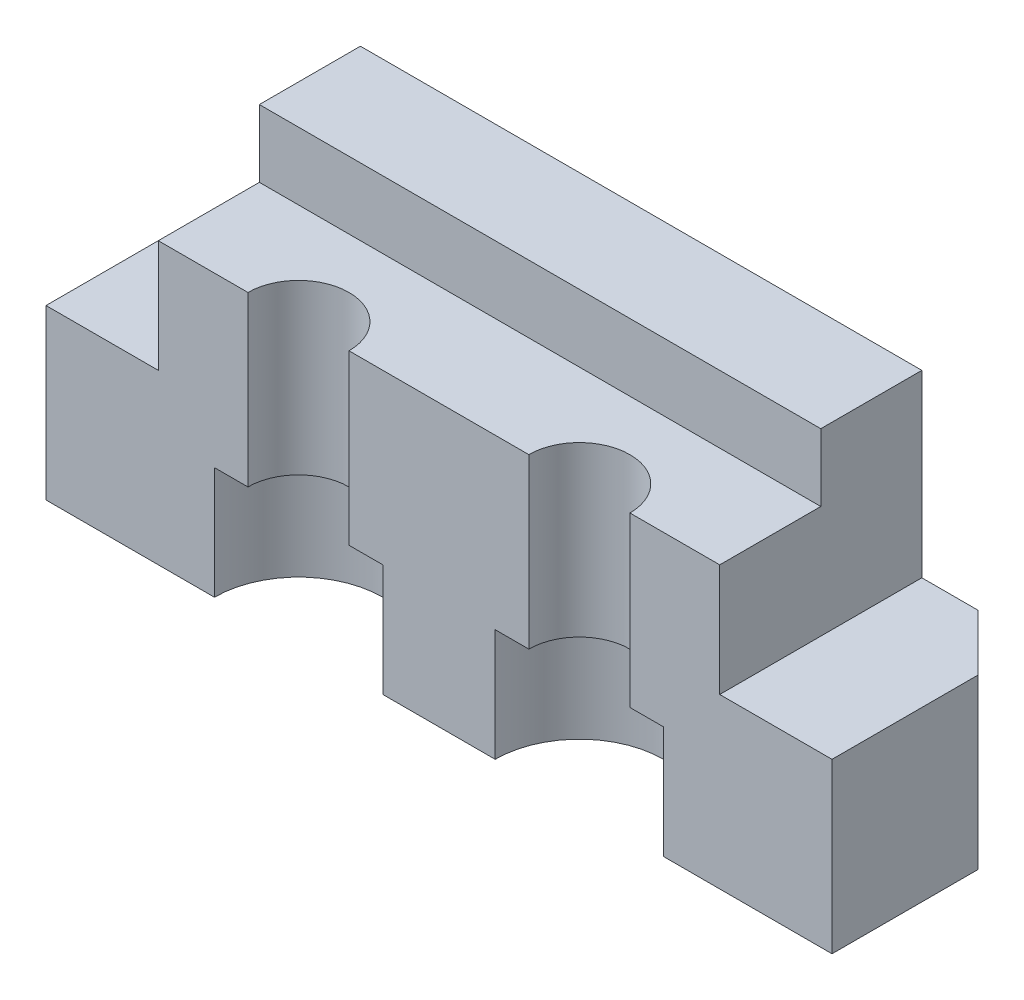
ISO-10303-21;
HEADER;
FILE_DESCRIPTION(('STEP AP214'),'2;1');
FILE_NAME('part.step','',(''),(''),'','','');
FILE_SCHEMA(('AUTOMOTIVE_DESIGN { 1 0 10303 214 1 1 1 1 }'));
ENDSEC;
DATA;
#1=APPLICATION_CONTEXT('core data for automotive mechanical design processes');
#2=APPLICATION_PROTOCOL_DEFINITION('international standard','automotive_design',2000,#1);
#3=PRODUCT_CONTEXT('',#1,'mechanical');
#4=PRODUCT('Part','Part','',(#3));
#5=PRODUCT_RELATED_PRODUCT_CATEGORY('part','',(#4));
#6=PRODUCT_DEFINITION_FORMATION('','',#4);
#7=PRODUCT_DEFINITION_CONTEXT('part definition',#1,'design');
#8=PRODUCT_DEFINITION('design','',#6,#7);
#9=PRODUCT_DEFINITION_SHAPE('','',#8);
#10=(LENGTH_UNIT() NAMED_UNIT(*) SI_UNIT(.MILLI.,.METRE.));
#11=(NAMED_UNIT(*) PLANE_ANGLE_UNIT() SI_UNIT($,.RADIAN.));
#12=(NAMED_UNIT(*) SI_UNIT($,.STERADIAN.) SOLID_ANGLE_UNIT());
#13=UNCERTAINTY_MEASURE_WITH_UNIT(LENGTH_MEASURE(1.E-05),#10,'distance_accuracy_value','');
#14=(GEOMETRIC_REPRESENTATION_CONTEXT(3) GLOBAL_UNCERTAINTY_ASSIGNED_CONTEXT((#13)) GLOBAL_UNIT_ASSIGNED_CONTEXT((#10,
#11,#12)) REPRESENTATION_CONTEXT('',''));
#15=CARTESIAN_POINT('',(0.,0.,0.));
#16=DIRECTION('',(0.,0.,1.));
#17=DIRECTION('',(1.,0.,0.));
#18=AXIS2_PLACEMENT_3D('',#15,#16,#17);
#19=CARTESIAN_POINT('',(70.,0.,-36.));
#20=DIRECTION('',(0.,-1.,0.));
#21=DIRECTION('',(1.,0.,0.));
#22=AXIS2_PLACEMENT_3D('',#19,#20,#21);
#23=PLANE('',#22);
#24=DIRECTION('',(-1.,0.,0.));
#25=VECTOR('',#24,1.);
#26=CARTESIAN_POINT('',(-2.5593542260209,0.,-18.));
#27=LINE('',#26,#25);
#28=CARTESIAN_POINT('',(15.,0.,-18.));
#29=VERTEX_POINT('',#28);
#30=CARTESIAN_POINT('',(0.,0.,-18.));
#31=VERTEX_POINT('',#30);
#32=EDGE_CURVE('E279',#29,#31,#27,.T.);
#33=ORIENTED_EDGE('',*,*,#32,.T.);
#34=DIRECTION('',(0.,0.,1.));
#35=VECTOR('',#34,1.);
#36=CARTESIAN_POINT('',(0.,0.,-36.));
#37=LINE('',#36,#35);
#38=CARTESIAN_POINT('',(0.,0.,-30.9999999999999));
#39=VERTEX_POINT('',#38);
#40=EDGE_CURVE('E203',#39,#31,#37,.T.);
#41=ORIENTED_EDGE('',*,*,#40,.F.);
#42=DIRECTION('',(0.707106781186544,0.,-0.707106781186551));
#43=VECTOR('',#42,1.);
#44=CARTESIAN_POINT('',(37.4999999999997,0.,-68.5));
#45=LINE('',#44,#43);
#46=CARTESIAN_POINT('',(5.00000000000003,0.,-36.));
#47=VERTEX_POINT('',#46);
#48=EDGE_CURVE('E259',#39,#47,#45,.T.);
#49=ORIENTED_EDGE('',*,*,#48,.T.);
#50=DIRECTION('',(1.,0.,0.));
#51=VECTOR('',#50,1.);
#52=CARTESIAN_POINT('',(70.,0.,-36.));
#53=LINE('',#52,#51);
#54=CARTESIAN_POINT('',(65.,0.,-36.));
#55=VERTEX_POINT('',#54);
#56=EDGE_CURVE('E199',#47,#55,#53,.T.);
#57=ORIENTED_EDGE('',*,*,#56,.T.);
#58=DIRECTION('',(0.707106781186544,0.,0.707106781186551));
#59=VECTOR('',#58,1.);
#60=CARTESIAN_POINT('',(67.5,0.,-33.5));
#61=LINE('',#60,#59);
#62=CARTESIAN_POINT('',(70.,0.,-30.9999999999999));
#63=VERTEX_POINT('',#62);
#64=EDGE_CURVE('E261',#55,#63,#61,.T.);
#65=ORIENTED_EDGE('',*,*,#64,.T.);
#66=DIRECTION('',(0.,0.,1.));
#67=VECTOR('',#66,1.);
#68=CARTESIAN_POINT('',(70.,0.,-36.));
#69=LINE('',#68,#67);
#70=CARTESIAN_POINT('',(70.,0.,-18.));
#71=VERTEX_POINT('',#70);
#72=EDGE_CURVE('E200',#63,#71,#69,.T.);
#73=ORIENTED_EDGE('',*,*,#72,.T.);
#74=CARTESIAN_POINT('',(55.,0.,-18.));
#75=VERTEX_POINT('',#74);
#76=EDGE_CURVE('E284',#71,#75,#27,.T.);
#77=ORIENTED_EDGE('',*,*,#76,.T.);
#78=CARTESIAN_POINT('',(47.5,0.,-18.));
#79=DIRECTION('',(0.,-1.,0.));
#80=DIRECTION('',(1.,0.,0.));
#81=AXIS2_PLACEMENT_3D('',#78,#79,#80);
#82=CIRCLE('',#81,7.5);
#83=CARTESIAN_POINT('',(40.,0.,-18.));
#84=VERTEX_POINT('',#83);
#85=EDGE_CURVE('E241',#84,#75,#82,.T.);
#86=ORIENTED_EDGE('',*,*,#85,.F.);
#87=CARTESIAN_POINT('',(30.,0.,-18.));
#88=VERTEX_POINT('',#87);
#89=EDGE_CURVE('E285',#84,#88,#27,.T.);
#90=ORIENTED_EDGE('',*,*,#89,.T.);
#91=CARTESIAN_POINT('',(22.5,0.,-18.));
#92=DIRECTION('',(0.,-1.,0.));
#93=DIRECTION('',(1.,0.,0.));
#94=AXIS2_PLACEMENT_3D('',#91,#92,#93);
#95=CIRCLE('',#94,7.5);
#96=EDGE_CURVE('E207',#29,#88,#95,.T.);
#97=ORIENTED_EDGE('',*,*,#96,.F.);
#98=EDGE_LOOP('',(#33,#41,#49,#57,#65,#73,#77,#86,#90,#97));
#99=FACE_BOUND('',#98,.T.);
#100=ADVANCED_FACE('F26',(#99),#23,.T.);
#101=CARTESIAN_POINT('',(0.,0.,-36.));
#102=DIRECTION('',(-1.,0.,0.));
#103=DIRECTION('',(0.,0.,1.));
#104=AXIS2_PLACEMENT_3D('',#101,#102,#103);
#105=PLANE('',#104);
#106=DIRECTION('',(0.,1.,0.));
#107=VECTOR('',#106,1.);
#108=CARTESIAN_POINT('',(0.,32.9264007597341,-18.));
#109=LINE('',#108,#107);
#110=CARTESIAN_POINT('',(0.,15.,-18.));
#111=VERTEX_POINT('',#110);
#112=EDGE_CURVE('E282',#31,#111,#109,.T.);
#113=ORIENTED_EDGE('',*,*,#112,.T.);
#114=DIRECTION('',(0.,0.,1.));
#115=VECTOR('',#114,1.);
#116=CARTESIAN_POINT('',(0.,15.,-36.));
#117=LINE('',#116,#115);
#118=CARTESIAN_POINT('',(0.,15.,-30.9999999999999));
#119=VERTEX_POINT('',#118);
#120=EDGE_CURVE('E222',#119,#111,#117,.T.);
#121=ORIENTED_EDGE('',*,*,#120,.F.);
#122=DIRECTION('',(0.,-1.,0.));
#123=VECTOR('',#122,1.);
#124=CARTESIAN_POINT('',(0.,0.,-30.9999999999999));
#125=LINE('',#124,#123);
#126=EDGE_CURVE('E34',#119,#39,#125,.T.);
#127=ORIENTED_EDGE('',*,*,#126,.T.);
#128=ORIENTED_EDGE('',*,*,#40,.T.);
#129=EDGE_LOOP('',(#113,#121,#127,#128));
#130=FACE_BOUND('',#129,.T.);
#131=ADVANCED_FACE('F272',(#130),#105,.T.);
#132=CARTESIAN_POINT('',(0.,15.,-36.));
#133=DIRECTION('',(0.,1.,0.));
#134=DIRECTION('',(0.,0.,1.));
#135=AXIS2_PLACEMENT_3D('',#132,#133,#134);
#136=PLANE('',#135);
#137=DIRECTION('',(1.,0.,0.));
#138=VECTOR('',#137,1.);
#139=CARTESIAN_POINT('',(-2.5593542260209,15.,-18.));
#140=LINE('',#139,#138);
#141=CARTESIAN_POINT('',(10.,15.,-18.));
#142=VERTEX_POINT('',#141);
#143=EDGE_CURVE('E179',#111,#142,#140,.T.);
#144=ORIENTED_EDGE('',*,*,#143,.T.);
#145=DIRECTION('',(0.,0.,1.));
#146=VECTOR('',#145,1.);
#147=CARTESIAN_POINT('',(10.,15.,-36.));
#148=LINE('',#147,#146);
#149=CARTESIAN_POINT('',(10.,15.,-36.));
#150=VERTEX_POINT('',#149);
#151=EDGE_CURVE('E178',#150,#142,#148,.T.);
#152=ORIENTED_EDGE('',*,*,#151,.F.);
#153=DIRECTION('',(-1.,0.,0.));
#154=VECTOR('',#153,1.);
#155=CARTESIAN_POINT('',(0.,15.,-36.));
#156=LINE('',#155,#154);
#157=CARTESIAN_POINT('',(5.00000000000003,15.,-36.));
#158=VERTEX_POINT('',#157);
#159=EDGE_CURVE('E225',#150,#158,#156,.T.);
#160=ORIENTED_EDGE('',*,*,#159,.T.);
#161=DIRECTION('',(-0.707106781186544,0.,0.707106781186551));
#162=VECTOR('',#161,1.);
#163=CARTESIAN_POINT('',(2.50000000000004,15.,-33.5));
#164=LINE('',#163,#162);
#165=EDGE_CURVE('E11',#158,#119,#164,.T.);
#166=ORIENTED_EDGE('',*,*,#165,.T.);
#167=ORIENTED_EDGE('',*,*,#120,.T.);
#168=EDGE_LOOP('',(#144,#152,#160,#166,#167));
#169=FACE_BOUND('',#168,.T.);
#170=ADVANCED_FACE('F336',(#169),#136,.T.);
#171=CARTESIAN_POINT('',(10.,15.,-36.));
#172=DIRECTION('',(-1.,0.,0.));
#173=DIRECTION('',(0.,0.,1.));
#174=AXIS2_PLACEMENT_3D('',#171,#172,#173);
#175=PLANE('',#174);
#176=DIRECTION('',(0.,1.,0.));
#177=VECTOR('',#176,1.);
#178=CARTESIAN_POINT('',(10.,32.9264007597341,-18.));
#179=LINE('',#178,#177);
#180=CARTESIAN_POINT('',(10.,25.,-18.));
#181=VERTEX_POINT('',#180);
#182=EDGE_CURVE('E162',#142,#181,#179,.T.);
#183=ORIENTED_EDGE('',*,*,#182,.T.);
#184=DIRECTION('',(0.,0.,1.));
#185=VECTOR('',#184,1.);
#186=CARTESIAN_POINT('',(10.,25.,-36.));
#187=LINE('',#186,#185);
#188=CARTESIAN_POINT('',(10.,25.,-27.));
#189=VERTEX_POINT('',#188);
#190=EDGE_CURVE('E176',#189,#181,#187,.T.);
#191=ORIENTED_EDGE('',*,*,#190,.F.);
#192=DIRECTION('',(0.,-1.,0.));
#193=VECTOR('',#192,1.);
#194=CARTESIAN_POINT('',(10.,15.,-27.));
#195=LINE('',#194,#193);
#196=CARTESIAN_POINT('',(10.,31.,-27.));
#197=VERTEX_POINT('',#196);
#198=EDGE_CURVE('E189',#197,#189,#195,.T.);
#199=ORIENTED_EDGE('',*,*,#198,.F.);
#200=DIRECTION('',(0.,0.,1.));
#201=VECTOR('',#200,1.);
#202=CARTESIAN_POINT('',(10.,31.,-36.));
#203=LINE('',#202,#201);
#204=CARTESIAN_POINT('',(10.,31.,-36.));
#205=VERTEX_POINT('',#204);
#206=EDGE_CURVE('E216',#205,#197,#203,.T.);
#207=ORIENTED_EDGE('',*,*,#206,.F.);
#208=DIRECTION('',(0.,-1.,0.));
#209=VECTOR('',#208,1.);
#210=CARTESIAN_POINT('',(10.,15.,-36.));
#211=LINE('',#210,#209);
#212=EDGE_CURVE('E221',#205,#150,#211,.T.);
#213=ORIENTED_EDGE('',*,*,#212,.T.);
#214=ORIENTED_EDGE('',*,*,#151,.T.);
#215=EDGE_LOOP('',(#183,#191,#199,#207,#213,#214));
#216=FACE_BOUND('',#215,.T.);
#217=ADVANCED_FACE('F174',(#216),#175,.T.);
#218=CARTESIAN_POINT('',(10.,31.,-36.));
#219=DIRECTION('',(0.,1.,0.));
#220=DIRECTION('',(0.,0.,1.));
#221=AXIS2_PLACEMENT_3D('',#218,#219,#220);
#222=PLANE('',#221);
#223=DIRECTION('',(-1.,0.,0.));
#224=VECTOR('',#223,1.);
#225=CARTESIAN_POINT('',(10.,31.,-27.));
#226=LINE('',#225,#224);
#227=CARTESIAN_POINT('',(60.,31.,-27.));
#228=VERTEX_POINT('',#227);
#229=EDGE_CURVE('E186',#228,#197,#226,.T.);
#230=ORIENTED_EDGE('',*,*,#229,.F.);
#231=DIRECTION('',(0.,0.,1.));
#232=VECTOR('',#231,1.);
#233=CARTESIAN_POINT('',(60.,31.,-36.));
#234=LINE('',#233,#232);
#235=CARTESIAN_POINT('',(60.,31.,-36.));
#236=VERTEX_POINT('',#235);
#237=EDGE_CURVE('E212',#236,#228,#234,.T.);
#238=ORIENTED_EDGE('',*,*,#237,.F.);
#239=DIRECTION('',(-1.,0.,0.));
#240=VECTOR('',#239,1.);
#241=CARTESIAN_POINT('',(10.,31.,-36.));
#242=LINE('',#241,#240);
#243=EDGE_CURVE('E219',#236,#205,#242,.T.);
#244=ORIENTED_EDGE('',*,*,#243,.T.);
#245=ORIENTED_EDGE('',*,*,#206,.T.);
#246=EDGE_LOOP('',(#230,#238,#244,#245));
#247=FACE_BOUND('',#246,.T.);
#248=ADVANCED_FACE('F28',(#247),#222,.T.);
#249=CARTESIAN_POINT('',(60.,31.,-36.));
#250=DIRECTION('',(1.,0.,0.));
#251=DIRECTION('',(0.,1.,0.));
#252=AXIS2_PLACEMENT_3D('',#249,#250,#251);
#253=PLANE('',#252);
#254=DIRECTION('',(0.,-1.,0.));
#255=VECTOR('',#254,1.);
#256=CARTESIAN_POINT('',(60.,32.9264007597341,-18.));
#257=LINE('',#256,#255);
#258=CARTESIAN_POINT('',(60.,25.,-18.));
#259=VERTEX_POINT('',#258);
#260=CARTESIAN_POINT('',(60.,15.,-18.));
#261=VERTEX_POINT('',#260);
#262=EDGE_CURVE('E290',#259,#261,#257,.T.);
#263=ORIENTED_EDGE('',*,*,#262,.T.);
#264=DIRECTION('',(0.,0.,1.));
#265=VECTOR('',#264,1.);
#266=CARTESIAN_POINT('',(60.,15.,-36.));
#267=LINE('',#266,#265);
#268=CARTESIAN_POINT('',(60.,15.,-36.));
#269=VERTEX_POINT('',#268);
#270=EDGE_CURVE('E208',#269,#261,#267,.T.);
#271=ORIENTED_EDGE('',*,*,#270,.F.);
#272=DIRECTION('',(0.,1.,0.));
#273=VECTOR('',#272,1.);
#274=CARTESIAN_POINT('',(60.,31.,-36.));
#275=LINE('',#274,#273);
#276=EDGE_CURVE('E215',#269,#236,#275,.T.);
#277=ORIENTED_EDGE('',*,*,#276,.T.);
#278=ORIENTED_EDGE('',*,*,#237,.T.);
#279=DIRECTION('',(0.,1.,0.));
#280=VECTOR('',#279,1.);
#281=CARTESIAN_POINT('',(60.,32.0164446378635,-27.));
#282=LINE('',#281,#280);
#283=CARTESIAN_POINT('',(60.,25.,-27.));
#284=VERTEX_POINT('',#283);
#285=EDGE_CURVE('E317',#284,#228,#282,.T.);
#286=ORIENTED_EDGE('',*,*,#285,.F.);
#287=DIRECTION('',(0.,0.,-1.));
#288=VECTOR('',#287,1.);
#289=CARTESIAN_POINT('',(60.,25.,-9.));
#290=LINE('',#289,#288);
#291=EDGE_CURVE('E315',#259,#284,#290,.T.);
#292=ORIENTED_EDGE('',*,*,#291,.F.);
#293=EDGE_LOOP('',(#263,#271,#277,#278,#286,#292));
#294=FACE_BOUND('',#293,.T.);
#295=ADVANCED_FACE('F324',(#294),#253,.T.);
#296=CARTESIAN_POINT('',(60.,15.,-36.));
#297=DIRECTION('',(0.,1.,0.));
#298=DIRECTION('',(0.,0.,1.));
#299=AXIS2_PLACEMENT_3D('',#296,#297,#298);
#300=PLANE('',#299);
#301=DIRECTION('',(1.,0.,0.));
#302=VECTOR('',#301,1.);
#303=CARTESIAN_POINT('',(-2.5593542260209,15.,-18.));
#304=LINE('',#303,#302);
#305=CARTESIAN_POINT('',(70.,15.,-18.));
#306=VERTEX_POINT('',#305);
#307=EDGE_CURVE('E312',#261,#306,#304,.T.);
#308=ORIENTED_EDGE('',*,*,#307,.T.);
#309=DIRECTION('',(0.,0.,1.));
#310=VECTOR('',#309,1.);
#311=CARTESIAN_POINT('',(70.,15.,-36.));
#312=LINE('',#311,#310);
#313=CARTESIAN_POINT('',(70.,15.,-30.9999999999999));
#314=VERTEX_POINT('',#313);
#315=EDGE_CURVE('E204',#314,#306,#312,.T.);
#316=ORIENTED_EDGE('',*,*,#315,.F.);
#317=DIRECTION('',(-0.707106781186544,0.,-0.707106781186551));
#318=VECTOR('',#317,1.);
#319=CARTESIAN_POINT('',(62.5,15.,-38.5));
#320=LINE('',#319,#318);
#321=CARTESIAN_POINT('',(65.,15.,-36.));
#322=VERTEX_POINT('',#321);
#323=EDGE_CURVE('E252',#314,#322,#320,.T.);
#324=ORIENTED_EDGE('',*,*,#323,.T.);
#325=DIRECTION('',(-1.,0.,0.));
#326=VECTOR('',#325,1.);
#327=CARTESIAN_POINT('',(60.,15.,-36.));
#328=LINE('',#327,#326);
#329=EDGE_CURVE('E211',#322,#269,#328,.T.);
#330=ORIENTED_EDGE('',*,*,#329,.T.);
#331=ORIENTED_EDGE('',*,*,#270,.T.);
#332=EDGE_LOOP('',(#308,#316,#324,#330,#331));
#333=FACE_BOUND('',#332,.T.);
#334=ADVANCED_FACE('F364',(#333),#300,.T.);
#335=CARTESIAN_POINT('',(70.,15.,-36.));
#336=DIRECTION('',(1.,0.,0.));
#337=DIRECTION('',(0.,0.,-1.));
#338=AXIS2_PLACEMENT_3D('',#335,#336,#337);
#339=PLANE('',#338);
#340=DIRECTION('',(0.,-1.,0.));
#341=VECTOR('',#340,1.);
#342=CARTESIAN_POINT('',(70.,32.9264007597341,-18.));
#343=LINE('',#342,#341);
#344=EDGE_CURVE('E289',#306,#71,#343,.T.);
#345=ORIENTED_EDGE('',*,*,#344,.T.);
#346=ORIENTED_EDGE('',*,*,#72,.F.);
#347=DIRECTION('',(0.,1.,0.));
#348=VECTOR('',#347,1.);
#349=CARTESIAN_POINT('',(70.,15.,-30.9999999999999));
#350=LINE('',#349,#348);
#351=EDGE_CURVE('E256',#63,#314,#350,.T.);
#352=ORIENTED_EDGE('',*,*,#351,.T.);
#353=ORIENTED_EDGE('',*,*,#315,.T.);
#354=EDGE_LOOP('',(#345,#346,#352,#353));
#355=FACE_BOUND('',#354,.T.);
#356=ADVANCED_FACE('F361',(#355),#339,.T.);
#357=CARTESIAN_POINT('',(70.,0.,-36.));
#358=DIRECTION('',(0.,0.,1.));
#359=DIRECTION('',(1.,0.,0.));
#360=AXIS2_PLACEMENT_3D('',#357,#358,#359);
#361=PLANE('',#360);
#362=ORIENTED_EDGE('',*,*,#329,.F.);
#363=DIRECTION('',(0.,-1.,0.));
#364=VECTOR('',#363,1.);
#365=CARTESIAN_POINT('',(65.,0.,-36.));
#366=LINE('',#365,#364);
#367=EDGE_CURVE('E265',#322,#55,#366,.T.);
#368=ORIENTED_EDGE('',*,*,#367,.T.);
#369=ORIENTED_EDGE('',*,*,#56,.F.);
#370=DIRECTION('',(0.,1.,0.));
#371=VECTOR('',#370,1.);
#372=CARTESIAN_POINT('',(5.00000000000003,15.,-36.));
#373=LINE('',#372,#371);
#374=EDGE_CURVE('E263',#47,#158,#373,.T.);
#375=ORIENTED_EDGE('',*,*,#374,.T.);
#376=ORIENTED_EDGE('',*,*,#159,.F.);
#377=ORIENTED_EDGE('',*,*,#212,.F.);
#378=ORIENTED_EDGE('',*,*,#243,.F.);
#379=ORIENTED_EDGE('',*,*,#276,.F.);
#380=EDGE_LOOP('',(#362,#368,#369,#375,#376,#377,#378,#379));
#381=FACE_BOUND('',#380,.T.);
#382=ADVANCED_FACE('F332',(#381),#361,.F.);
#383=CARTESIAN_POINT('',(22.5,10.,-18.));
#384=DIRECTION('',(0.,-1.,0.));
#385=DIRECTION('',(1.,0.,0.));
#386=AXIS2_PLACEMENT_3D('',#383,#384,#385);
#387=CYLINDRICAL_SURFACE('',#386,7.5);
#388=CARTESIAN_POINT('',(22.5,10.,-18.));
#389=DIRECTION('',(0.,-1.,0.));
#390=DIRECTION('',(1.,0.,0.));
#391=AXIS2_PLACEMENT_3D('',#388,#389,#390);
#392=CIRCLE('',#391,7.5);
#393=CARTESIAN_POINT('',(15.,10.,-18.));
#394=VERTEX_POINT('',#393);
#395=CARTESIAN_POINT('',(30.,10.,-18.));
#396=VERTEX_POINT('',#395);
#397=EDGE_CURVE('E238',#394,#396,#392,.T.);
#398=ORIENTED_EDGE('',*,*,#397,.F.);
#399=DIRECTION('',(0.,-1.,0.));
#400=VECTOR('',#399,1.);
#401=CARTESIAN_POINT('',(15.,10.,-18.));
#402=LINE('',#401,#400);
#403=EDGE_CURVE('E180',#29,#394,#402,.F.);
#404=ORIENTED_EDGE('',*,*,#403,.F.);
#405=ORIENTED_EDGE('',*,*,#96,.T.);
#406=DIRECTION('',(0.,-1.,0.));
#407=VECTOR('',#406,1.);
#408=CARTESIAN_POINT('',(30.,10.,-18.));
#409=LINE('',#408,#407);
#410=EDGE_CURVE('E291',#396,#88,#409,.T.);
#411=ORIENTED_EDGE('',*,*,#410,.F.);
#412=EDGE_LOOP('',(#398,#404,#405,#411));
#413=FACE_BOUND('',#412,.T.);
#414=ADVANCED_FACE('F377',(#413),#387,.F.);
#415=CARTESIAN_POINT('',(22.5,10.,-18.));
#416=DIRECTION('',(0.,-1.,0.));
#417=DIRECTION('',(1.,0.,0.));
#418=AXIS2_PLACEMENT_3D('',#415,#416,#417);
#419=PLANE('',#418);
#420=DIRECTION('',(-1.,0.,0.));
#421=VECTOR('',#420,1.);
#422=CARTESIAN_POINT('',(-2.5593542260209,10.,-18.));
#423=LINE('',#422,#421);
#424=CARTESIAN_POINT('',(17.9845869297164,10.,-18.));
#425=VERTEX_POINT('',#424);
#426=EDGE_CURVE('E300',#425,#394,#423,.T.);
#427=ORIENTED_EDGE('',*,*,#426,.T.);
#428=ORIENTED_EDGE('',*,*,#397,.T.);
#429=CARTESIAN_POINT('',(26.9845869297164,10.,-18.));
#430=VERTEX_POINT('',#429);
#431=EDGE_CURVE('E294',#396,#430,#423,.T.);
#432=ORIENTED_EDGE('',*,*,#431,.T.);
#433=CARTESIAN_POINT('',(22.4845869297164,10.,-18.));
#434=DIRECTION('',(0.,-1.,0.));
#435=DIRECTION('',(1.,0.,0.));
#436=AXIS2_PLACEMENT_3D('',#433,#434,#435);
#437=CIRCLE('',#436,4.5);
#438=EDGE_CURVE('E247',#425,#430,#437,.T.);
#439=ORIENTED_EDGE('',*,*,#438,.F.);
#440=EDGE_LOOP('',(#427,#428,#432,#439));
#441=FACE_BOUND('',#440,.T.);
#442=ADVANCED_FACE('F380',(#441),#419,.T.);
#443=CARTESIAN_POINT('',(47.5,10.,-18.));
#444=DIRECTION('',(0.,-1.,0.));
#445=DIRECTION('',(1.,0.,0.));
#446=AXIS2_PLACEMENT_3D('',#443,#444,#445);
#447=CYLINDRICAL_SURFACE('',#446,7.5);
#448=CARTESIAN_POINT('',(47.5,10.,-18.));
#449=DIRECTION('',(0.,-1.,0.));
#450=DIRECTION('',(1.,0.,0.));
#451=AXIS2_PLACEMENT_3D('',#448,#449,#450);
#452=CIRCLE('',#451,7.5);
#453=CARTESIAN_POINT('',(40.,10.,-18.));
#454=VERTEX_POINT('',#453);
#455=CARTESIAN_POINT('',(55.,10.,-18.));
#456=VERTEX_POINT('',#455);
#457=EDGE_CURVE('E244',#454,#456,#452,.T.);
#458=ORIENTED_EDGE('',*,*,#457,.F.);
#459=DIRECTION('',(0.,-1.,0.));
#460=VECTOR('',#459,1.);
#461=CARTESIAN_POINT('',(40.,10.,-18.));
#462=LINE('',#461,#460);
#463=EDGE_CURVE('E298',#84,#454,#462,.F.);
#464=ORIENTED_EDGE('',*,*,#463,.F.);
#465=ORIENTED_EDGE('',*,*,#85,.T.);
#466=DIRECTION('',(0.,-1.,0.));
#467=VECTOR('',#466,1.);
#468=CARTESIAN_POINT('',(55.,10.,-18.));
#469=LINE('',#468,#467);
#470=EDGE_CURVE('E306',#456,#75,#469,.T.);
#471=ORIENTED_EDGE('',*,*,#470,.F.);
#472=EDGE_LOOP('',(#458,#464,#465,#471));
#473=FACE_BOUND('',#472,.T.);
#474=ADVANCED_FACE('F382',(#473),#447,.F.);
#475=CARTESIAN_POINT('',(47.5,10.,-18.));
#476=DIRECTION('',(0.,-1.,0.));
#477=DIRECTION('',(1.,0.,0.));
#478=AXIS2_PLACEMENT_3D('',#475,#476,#477);
#479=PLANE('',#478);
#480=DIRECTION('',(-1.,0.,0.));
#481=VECTOR('',#480,1.);
#482=CARTESIAN_POINT('',(-2.5593542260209,10.,-18.));
#483=LINE('',#482,#481);
#484=CARTESIAN_POINT('',(43.,10.,-18.));
#485=VERTEX_POINT('',#484);
#486=EDGE_CURVE('E414',#485,#454,#483,.T.);
#487=ORIENTED_EDGE('',*,*,#486,.T.);
#488=ORIENTED_EDGE('',*,*,#457,.T.);
#489=CARTESIAN_POINT('',(52.,10.,-18.));
#490=VERTEX_POINT('',#489);
#491=EDGE_CURVE('E305',#456,#490,#483,.T.);
#492=ORIENTED_EDGE('',*,*,#491,.T.);
#493=CARTESIAN_POINT('',(47.5,10.,-18.));
#494=DIRECTION('',(0.,-1.,0.));
#495=DIRECTION('',(1.,0.,0.));
#496=AXIS2_PLACEMENT_3D('',#493,#494,#495);
#497=CIRCLE('',#496,4.5);
#498=EDGE_CURVE('E196',#485,#490,#497,.T.);
#499=ORIENTED_EDGE('',*,*,#498,.F.);
#500=EDGE_LOOP('',(#487,#488,#492,#499));
#501=FACE_BOUND('',#500,.T.);
#502=ADVANCED_FACE('F385',(#501),#479,.T.);
#503=CARTESIAN_POINT('',(22.4845869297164,31.001,-18.));
#504=DIRECTION('',(0.,-1.,0.));
#505=DIRECTION('',(1.,0.,0.));
#506=AXIS2_PLACEMENT_3D('',#503,#504,#505);
#507=CYLINDRICAL_SURFACE('',#506,4.5);
#508=CARTESIAN_POINT('',(22.4845869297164,25.,-18.));
#509=DIRECTION('',(0.,-1.,0.));
#510=DIRECTION('',(1.,0.,0.));
#511=AXIS2_PLACEMENT_3D('',#508,#509,#510);
#512=CIRCLE('',#511,4.5);
#513=CARTESIAN_POINT('',(26.9845869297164,25.,-18.));
#514=VERTEX_POINT('',#513);
#515=CARTESIAN_POINT('',(17.9845869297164,25.,-18.));
#516=VERTEX_POINT('',#515);
#517=EDGE_CURVE('E187',#514,#516,#512,.F.);
#518=ORIENTED_EDGE('',*,*,#517,.T.);
#519=DIRECTION('',(0.,-1.,0.));
#520=VECTOR('',#519,1.);
#521=CARTESIAN_POINT('',(17.9845869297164,31.001,-18.));
#522=LINE('',#521,#520);
#523=EDGE_CURVE('E41',#425,#516,#522,.F.);
#524=ORIENTED_EDGE('',*,*,#523,.F.);
#525=ORIENTED_EDGE('',*,*,#438,.T.);
#526=DIRECTION('',(0.,-1.,0.));
#527=VECTOR('',#526,1.);
#528=CARTESIAN_POINT('',(26.9845869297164,31.001,-18.));
#529=LINE('',#528,#527);
#530=EDGE_CURVE('E404',#514,#430,#529,.T.);
#531=ORIENTED_EDGE('',*,*,#530,.F.);
#532=EDGE_LOOP('',(#518,#524,#525,#531));
#533=FACE_BOUND('',#532,.T.);
#534=ADVANCED_FACE('F389',(#533),#507,.F.);
#535=CARTESIAN_POINT('',(47.5,31.001,-18.));
#536=DIRECTION('',(0.,-1.,0.));
#537=DIRECTION('',(1.,0.,0.));
#538=AXIS2_PLACEMENT_3D('',#535,#536,#537);
#539=CYLINDRICAL_SURFACE('',#538,4.5);
#540=CARTESIAN_POINT('',(47.5,25.,-18.));
#541=DIRECTION('',(0.,-1.,0.));
#542=DIRECTION('',(1.,0.,0.));
#543=AXIS2_PLACEMENT_3D('',#540,#541,#542);
#544=CIRCLE('',#543,4.5);
#545=CARTESIAN_POINT('',(52.,25.,-18.));
#546=VERTEX_POINT('',#545);
#547=CARTESIAN_POINT('',(43.,25.,-18.));
#548=VERTEX_POINT('',#547);
#549=EDGE_CURVE('E191',#546,#548,#544,.F.);
#550=ORIENTED_EDGE('',*,*,#549,.T.);
#551=DIRECTION('',(0.,-1.,0.));
#552=VECTOR('',#551,1.);
#553=CARTESIAN_POINT('',(43.,31.001,-18.));
#554=LINE('',#553,#552);
#555=EDGE_CURVE('E49',#485,#548,#554,.F.);
#556=ORIENTED_EDGE('',*,*,#555,.F.);
#557=ORIENTED_EDGE('',*,*,#498,.T.);
#558=DIRECTION('',(0.,-1.,0.));
#559=VECTOR('',#558,1.);
#560=CARTESIAN_POINT('',(52.,31.001,-18.));
#561=LINE('',#560,#559);
#562=EDGE_CURVE('E293',#546,#490,#561,.T.);
#563=ORIENTED_EDGE('',*,*,#562,.F.);
#564=EDGE_LOOP('',(#550,#556,#557,#563));
#565=FACE_BOUND('',#564,.T.);
#566=ADVANCED_FACE('F359',(#565),#539,.F.);
#567=CARTESIAN_POINT('',(0.,25.,-9.));
#568=DIRECTION('',(0.,-1.,0.));
#569=DIRECTION('',(1.,0.,0.));
#570=AXIS2_PLACEMENT_3D('',#567,#568,#569);
#571=PLANE('',#570);
#572=ORIENTED_EDGE('',*,*,#190,.T.);
#573=DIRECTION('',(-1.,0.,0.));
#574=VECTOR('',#573,1.);
#575=CARTESIAN_POINT('',(-2.55935422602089,25.,-18.));
#576=LINE('',#575,#574);
#577=EDGE_CURVE('E159',#516,#181,#576,.T.);
#578=ORIENTED_EDGE('',*,*,#577,.F.);
#579=ORIENTED_EDGE('',*,*,#517,.F.);
#580=EDGE_CURVE('E170',#548,#514,#576,.T.);
#581=ORIENTED_EDGE('',*,*,#580,.F.);
#582=ORIENTED_EDGE('',*,*,#549,.F.);
#583=EDGE_CURVE('E169',#259,#546,#576,.T.);
#584=ORIENTED_EDGE('',*,*,#583,.F.);
#585=ORIENTED_EDGE('',*,*,#291,.T.);
#586=DIRECTION('',(1.,0.,0.));
#587=VECTOR('',#586,1.);
#588=CARTESIAN_POINT('',(0.,25.,-27.));
#589=LINE('',#588,#587);
#590=EDGE_CURVE('E185',#189,#284,#589,.T.);
#591=ORIENTED_EDGE('',*,*,#590,.F.);
#592=EDGE_LOOP('',(#572,#578,#579,#581,#582,#584,#585,#591));
#593=FACE_BOUND('',#592,.T.);
#594=ADVANCED_FACE('F183',(#593),#571,.F.);
#595=CARTESIAN_POINT('',(0.,32.0164446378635,-27.));
#596=DIRECTION('',(0.,0.,-1.));
#597=DIRECTION('',(-1.,0.,0.));
#598=AXIS2_PLACEMENT_3D('',#595,#596,#597);
#599=PLANE('',#598);
#600=ORIENTED_EDGE('',*,*,#198,.T.);
#601=ORIENTED_EDGE('',*,*,#590,.T.);
#602=ORIENTED_EDGE('',*,*,#285,.T.);
#603=ORIENTED_EDGE('',*,*,#229,.T.);
#604=EDGE_LOOP('',(#600,#601,#602,#603));
#605=FACE_BOUND('',#604,.T.);
#606=ADVANCED_FACE('F320',(#605),#599,.F.);
#607=CARTESIAN_POINT('',(70.,15.,-30.9999999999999));
#608=DIRECTION('',(0.707106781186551,0.,-0.707106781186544));
#609=DIRECTION('',(-0.707106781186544,0.,-0.707106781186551));
#610=AXIS2_PLACEMENT_3D('',#607,#608,#609);
#611=PLANE('',#610);
#612=ORIENTED_EDGE('',*,*,#64,.F.);
#613=ORIENTED_EDGE('',*,*,#367,.F.);
#614=ORIENTED_EDGE('',*,*,#323,.F.);
#615=ORIENTED_EDGE('',*,*,#351,.F.);
#616=EDGE_LOOP('',(#612,#613,#614,#615));
#617=FACE_BOUND('',#616,.T.);
#618=ADVANCED_FACE('F340',(#617),#611,.T.);
#619=CARTESIAN_POINT('',(0.,0.,-30.9999999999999));
#620=DIRECTION('',(-0.707106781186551,0.,-0.707106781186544));
#621=DIRECTION('',(-0.707106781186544,0.,0.707106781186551));
#622=AXIS2_PLACEMENT_3D('',#619,#620,#621);
#623=PLANE('',#622);
#624=ORIENTED_EDGE('',*,*,#165,.F.);
#625=ORIENTED_EDGE('',*,*,#374,.F.);
#626=ORIENTED_EDGE('',*,*,#48,.F.);
#627=ORIENTED_EDGE('',*,*,#126,.F.);
#628=EDGE_LOOP('',(#624,#625,#626,#627));
#629=FACE_BOUND('',#628,.T.);
#630=ADVANCED_FACE('F337',(#629),#623,.T.);
#631=CARTESIAN_POINT('',(-2.5593542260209,32.9264007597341,-18.));
#632=DIRECTION('',(0.,0.,-1.));
#633=DIRECTION('',(-1.,0.,0.));
#634=AXIS2_PLACEMENT_3D('',#631,#632,#633);
#635=PLANE('',#634);
#636=ORIENTED_EDGE('',*,*,#262,.F.);
#637=ORIENTED_EDGE('',*,*,#583,.T.);
#638=ORIENTED_EDGE('',*,*,#562,.T.);
#639=ORIENTED_EDGE('',*,*,#491,.F.);
#640=ORIENTED_EDGE('',*,*,#470,.T.);
#641=ORIENTED_EDGE('',*,*,#76,.F.);
#642=ORIENTED_EDGE('',*,*,#344,.F.);
#643=ORIENTED_EDGE('',*,*,#307,.F.);
#644=EDGE_LOOP('',(#636,#637,#638,#639,#640,#641,#642,#643));
#645=FACE_BOUND('',#644,.T.);
#646=ADVANCED_FACE('F339',(#645),#635,.F.);
#647=ORIENTED_EDGE('',*,*,#463,.T.);
#648=ORIENTED_EDGE('',*,*,#486,.F.);
#649=ORIENTED_EDGE('',*,*,#555,.T.);
#650=ORIENTED_EDGE('',*,*,#580,.T.);
#651=ORIENTED_EDGE('',*,*,#530,.T.);
#652=ORIENTED_EDGE('',*,*,#431,.F.);
#653=ORIENTED_EDGE('',*,*,#410,.T.);
#654=ORIENTED_EDGE('',*,*,#89,.F.);
#655=EDGE_LOOP('',(#647,#648,#649,#650,#651,#652,#653,#654));
#656=FACE_BOUND('',#655,.T.);
#657=ADVANCED_FACE('F347',(#656),#635,.F.);
#658=ORIENTED_EDGE('',*,*,#403,.T.);
#659=ORIENTED_EDGE('',*,*,#426,.F.);
#660=ORIENTED_EDGE('',*,*,#523,.T.);
#661=ORIENTED_EDGE('',*,*,#577,.T.);
#662=ORIENTED_EDGE('',*,*,#182,.F.);
#663=ORIENTED_EDGE('',*,*,#143,.F.);
#664=ORIENTED_EDGE('',*,*,#112,.F.);
#665=ORIENTED_EDGE('',*,*,#32,.F.);
#666=EDGE_LOOP('',(#658,#659,#660,#661,#662,#663,#664,#665));
#667=FACE_BOUND('',#666,.T.);
#668=ADVANCED_FACE('F161',(#667),#635,.F.);
#669=CLOSED_SHELL('',(#100,#131,#170,#217,#248,#295,#334,#356,#382,#414,#442,#474,#502,#534,
#566,#594,#606,#618,#630,#646,#657,#668));
#670=MANIFOLD_SOLID_BREP('B2',#669);
#671=ADVANCED_BREP_SHAPE_REPRESENTATION('',(#18,#670),#14);
#672=SHAPE_DEFINITION_REPRESENTATION(#9,#671);
ENDSEC;
END-ISO-10303-21;
